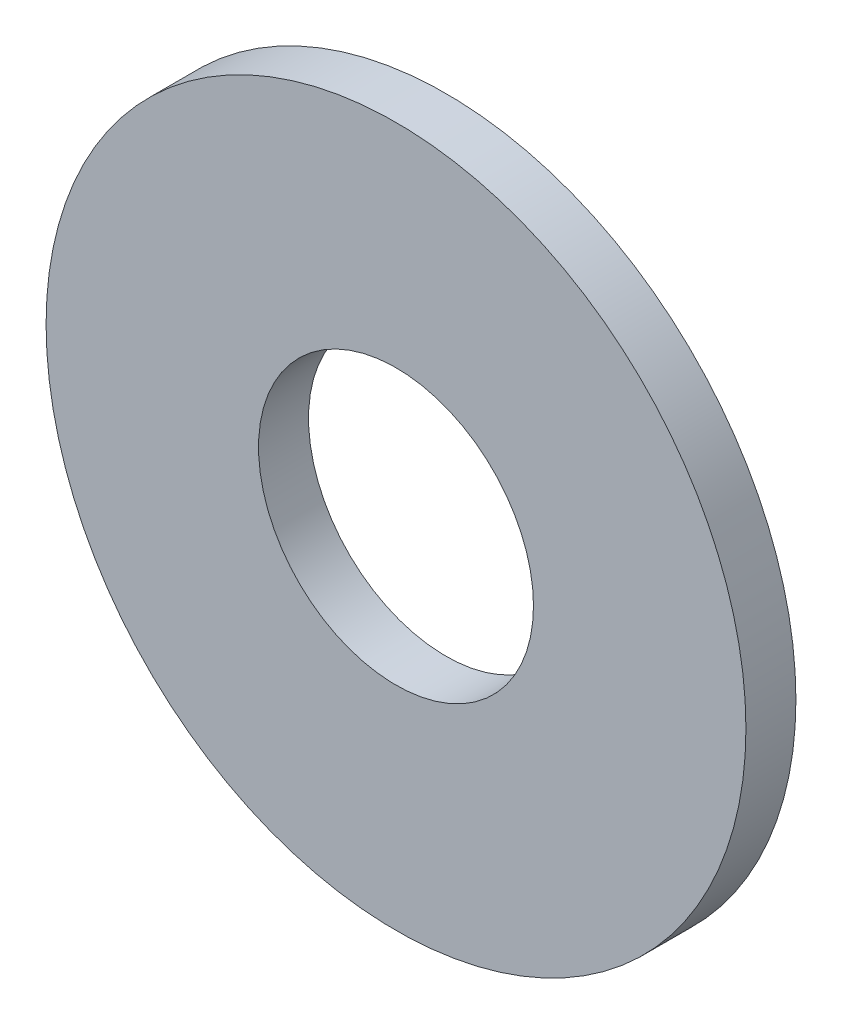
from build123d import *

# Parameters (mm, degrees)
ESQUISSE1_R           = 14
EXTRUSION1_DEPTH      = 2
D_GAGEMENT_M101_D     = 11
D_GAGEMENT_M101_DEPTH = 10
D_GAGEMENT_M101_TIP   = 3.304733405


with BuildPart() as part:
    # Esquisse1 → Extrusion1 (new body)
    with BuildSketch(Plane.XY):
        Circle(ESQUISSE1_R)
    extrude(amount=EXTRUSION1_DEPTH)

    # D_gagement M101
    with Locations(Plane.XY.offset(2)):
        with Locations((0, 0)):
            Hole(D_GAGEMENT_M101_D / 2, depth=D_GAGEMENT_M101_DEPTH)
            with Locations((0, 0, -(D_GAGEMENT_M101_DEPTH + D_GAGEMENT_M101_TIP / 2))):  # 118° drill point
                Cone(0, D_GAGEMENT_M101_D / 2, D_GAGEMENT_M101_TIP, mode=Mode.SUBTRACT)


solid = part.part
